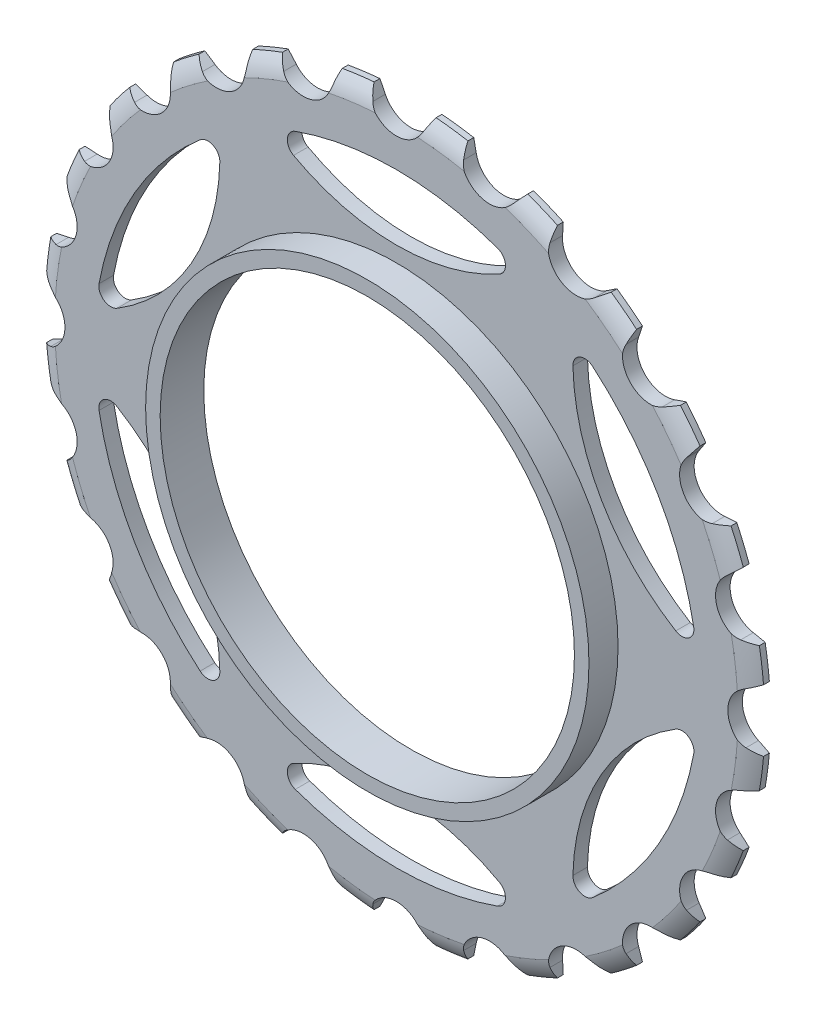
from build123d import *

# Parameters (mm, degrees)
EXTRUDE1_DEPTH      = 71.013855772
EXTRUDE2_DEPTH      = 71.013855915
CIRPATTERN1_COUNT   = 24
CIRPATTERN2_COUNT   = 6
SKETCH4_R           = 30.5
SKETCH4_R_2         = 28.5
EXTRUDE_THIN1_DEPTH = 4


with BuildPart() as part:
    # Sketch2 → Revolve1 (revolve)
    with BuildSketch(Plane(origin=(0, 0, 0), x_dir=(0, 0, -1), z_dir=(1, 0, 0)), mode=Mode.PRIVATE) as revolve1_sk:
        with BuildLine():
            Line((-1.2, 28.5), (0.8, 28.5))
            Line((0.8, 28.5), (0.8, 49.5))
            Line((0.8, 49.5), (0, 49.5))
            ThreePointArc((0, 49.5), (-0.760147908, 48.326870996), (-1.2, 47))
            Line((-1.2, 47), (-1.2, 28.5))
        make_face()
    revolve(revolve1_sk.sketch.rotate(Axis((0, 0, -80.9), (0, 0, 1)), 90), axis=Axis((0, 0, -80.9), (0, 0, 1)))

    # Sketch1 → Extrude1 (cut, symmetric)
    with BuildSketch(Plane.XY):
        with BuildLine():
            ThreePointArc((-5.782452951, 52.029662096), (-4.600790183, 49.950146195), (-3.518319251, 47.817314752))
            ThreePointArc((-3.518319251, 47.817314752), (0, 45.6), (3.518319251, 47.817314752))
            ThreePointArc((3.518319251, 47.817314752), (4.600790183, 49.950146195), (5.782452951, 52.029662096))
            ThreePointArc((5.782452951, 52.029662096), (0, 52.35), (-5.782452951, 52.029662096))
        make_face()
    extrude1 = extrude(amount=EXTRUDE1_DEPTH, both=True, mode=Mode.SUBTRACT)

    # Sketch3 → Extrude2 (cut, symmetric)
    with BuildSketch(Plane.XY):
        with BuildLine():
            ThreePointArc((-14.150056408, 36.214473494), (0, 32.6), (14.150056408, 36.214473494))
            ThreePointArc((14.150056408, 36.214473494), (15, 37.78703769), (13.91150626, 39.204974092))
            ThreePointArc((13.91150626, 39.204974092), (0, 41.6), (-13.91150626, 39.204974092))
            ThreePointArc((-13.91150626, 39.204974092), (-15, 37.78703769), (-14.150056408, 36.214473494))
        make_face()
    extrude2 = extrude(amount=EXTRUDE2_DEPTH, both=True, mode=Mode.SUBTRACT)

    # CirPattern1: Extrude1 ×24 about axis
    cirpattern1_axis = Axis((0, 0, 0), (0, 0, 1))
    for i in range(1, CIRPATTERN1_COUNT):
        add(extrude1.rotate(cirpattern1_axis, i * 360 / CIRPATTERN1_COUNT), mode=Mode.SUBTRACT)

    # CirPattern2: Extrude2 ×6 about axis
    cirpattern2_axis = Axis((0, 0, 0), (0, 0, 1))
    for i in range(1, CIRPATTERN2_COUNT):
        add(extrude2.rotate(cirpattern2_axis, i * 360 / CIRPATTERN2_COUNT), mode=Mode.SUBTRACT)

    # Sketch4 → Extrude-Thin1 (add)
    with BuildSketch(Plane.XY.offset(1.2)):
        Circle(SKETCH4_R)
        Circle(SKETCH4_R_2, mode=Mode.SUBTRACT)
    extrude(amount=EXTRUDE_THIN1_DEPTH)


solid = part.part
